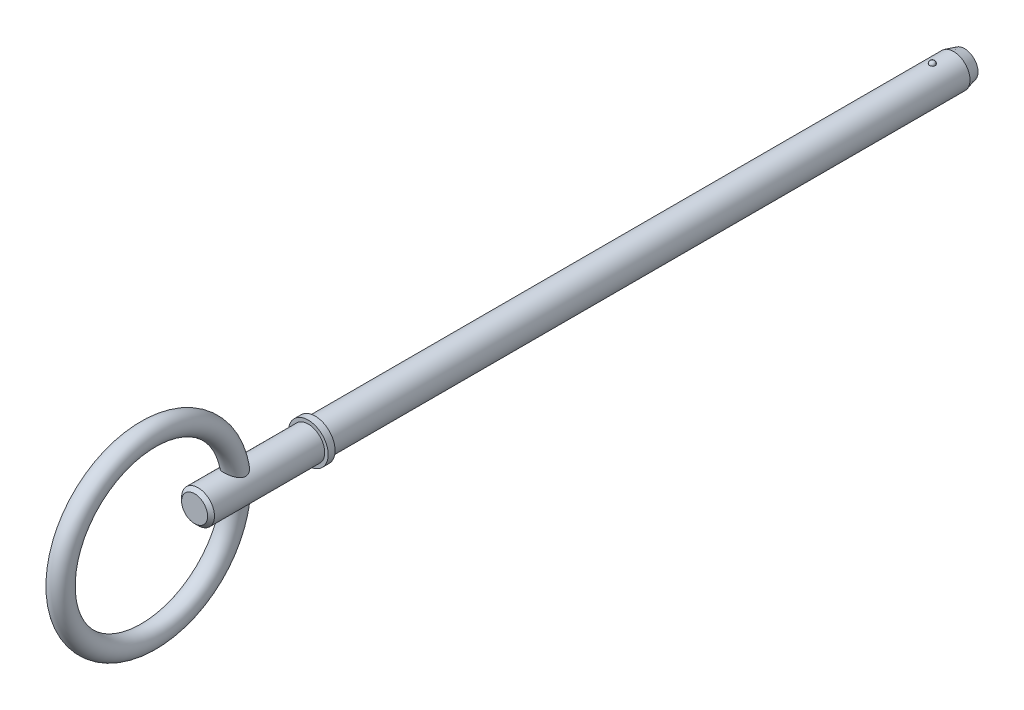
ISO-10303-21;
HEADER;
FILE_DESCRIPTION(('STEP AP214'),'2;1');
FILE_NAME('part.step','',(''),(''),'','','');
FILE_SCHEMA(('AUTOMOTIVE_DESIGN { 1 0 10303 214 1 1 1 1 }'));
ENDSEC;
DATA;
#1=APPLICATION_CONTEXT('core data for automotive mechanical design processes');
#2=APPLICATION_PROTOCOL_DEFINITION('international standard','automotive_design',2000,#1);
#3=PRODUCT_CONTEXT('',#1,'mechanical');
#4=PRODUCT('Part','Part','',(#3));
#5=PRODUCT_RELATED_PRODUCT_CATEGORY('part','',(#4));
#6=PRODUCT_DEFINITION_FORMATION('','',#4);
#7=PRODUCT_DEFINITION_CONTEXT('part definition',#1,'design');
#8=PRODUCT_DEFINITION('design','',#6,#7);
#9=PRODUCT_DEFINITION_SHAPE('','',#8);
#10=(LENGTH_UNIT() NAMED_UNIT(*) SI_UNIT(.MILLI.,.METRE.));
#11=(NAMED_UNIT(*) PLANE_ANGLE_UNIT() SI_UNIT($,.RADIAN.));
#12=(NAMED_UNIT(*) SI_UNIT($,.STERADIAN.) SOLID_ANGLE_UNIT());
#13=UNCERTAINTY_MEASURE_WITH_UNIT(LENGTH_MEASURE(1.E-05),#10,'distance_accuracy_value','');
#14=(GEOMETRIC_REPRESENTATION_CONTEXT(3) GLOBAL_UNCERTAINTY_ASSIGNED_CONTEXT((#13)) GLOBAL_UNIT_ASSIGNED_CONTEXT((#10,
#11,#12)) REPRESENTATION_CONTEXT('',''));
#15=CARTESIAN_POINT('',(0.,0.,0.));
#16=DIRECTION('',(0.,0.,1.));
#17=DIRECTION('',(1.,0.,0.));
#18=AXIS2_PLACEMENT_3D('',#15,#16,#17);
#19=CARTESIAN_POINT('',(0.,0.,88.9));
#20=DIRECTION('',(0.,0.,-1.));
#21=DIRECTION('',(-1.,0.,0.));
#22=AXIS2_PLACEMENT_3D('',#19,#20,#21);
#23=CYLINDRICAL_SURFACE('',#22,2.38);
#24=CARTESIAN_POINT('',(0.418361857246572,2.34294117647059,-0.419999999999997));
#25=CARTESIAN_POINT('',(0.418361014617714,2.34294160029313,-0.396453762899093));
#26=CARTESIAN_POINT('',(0.416399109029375,2.34329426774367,-0.372895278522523));
#27=CARTESIAN_POINT('',(0.408599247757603,2.34466666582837,-0.32643458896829));
#28=CARTESIAN_POINT('',(0.402757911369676,2.34568697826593,-0.303532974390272));
#29=CARTESIAN_POINT('',(0.387358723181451,2.3482789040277,-0.259059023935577));
#30=CARTESIAN_POINT('',(0.377802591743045,2.34985026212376,-0.237486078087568));
#31=CARTESIAN_POINT('',(0.355233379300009,2.35336760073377,-0.196270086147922));
#32=CARTESIAN_POINT('',(0.34222083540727,2.3553135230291,-0.176626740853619));
#33=CARTESIAN_POINT('',(0.313060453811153,2.35936636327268,-0.139777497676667));
#34=CARTESIAN_POINT('',(0.296906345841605,2.36147359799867,-0.122576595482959));
#35=CARTESIAN_POINT('',(0.261921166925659,2.3656092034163,-0.0911421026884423));
#36=CARTESIAN_POINT('',(0.243090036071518,2.36763757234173,-0.0769085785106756));
#37=CARTESIAN_POINT('',(0.203297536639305,2.37138533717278,-0.0518262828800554));
#38=CARTESIAN_POINT('',(0.182338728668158,2.37310509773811,-0.0409735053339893));
#39=CARTESIAN_POINT('',(0.138864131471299,2.37604521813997,-0.0229395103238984));
#40=CARTESIAN_POINT('',(0.116348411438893,2.37726560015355,-0.0157581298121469));
#41=CARTESIAN_POINT('',(0.0705754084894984,2.37906276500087,-0.00531205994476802));
#42=CARTESIAN_POINT('',(0.0473247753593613,2.37964420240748,-0.00201903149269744));
#43=CARTESIAN_POINT('',(0.000593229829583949,2.38011460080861,0.000651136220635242));
#44=CARTESIAN_POINT('',(-0.0228876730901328,2.38000359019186,2.84360175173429E-05));
#45=CARTESIAN_POINT('',(-0.0692686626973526,2.37910422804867,-0.00509943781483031));
#46=CARTESIAN_POINT('',(-0.0921713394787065,2.37831983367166,-0.00958192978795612));
#47=CARTESIAN_POINT('',(-0.136890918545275,2.37616546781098,-0.022272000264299));
#48=CARTESIAN_POINT('',(-0.158707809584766,2.37479549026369,-0.0304796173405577));
#49=CARTESIAN_POINT('',(-0.200704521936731,2.37161607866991,-0.0504168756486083));
#50=CARTESIAN_POINT('',(-0.220879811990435,2.36980547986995,-0.0621558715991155));
#51=CARTESIAN_POINT('',(-0.258974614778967,2.36594575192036,-0.0888218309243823));
#52=CARTESIAN_POINT('',(-0.276894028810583,2.36389661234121,-0.103748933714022));
#53=CARTESIAN_POINT('',(-0.310124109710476,2.35976825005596,-0.136509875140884));
#54=CARTESIAN_POINT('',(-0.325413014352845,2.35768891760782,-0.154365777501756));
#55=CARTESIAN_POINT('',(-0.352793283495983,2.35374782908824,-0.192402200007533));
#56=CARTESIAN_POINT('',(-0.364884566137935,2.35188607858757,-0.212582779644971));
#57=CARTESIAN_POINT('',(-0.385587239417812,2.34858114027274,-0.254794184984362));
#58=CARTESIAN_POINT('',(-0.394183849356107,2.34713973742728,-0.276832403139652));
#59=CARTESIAN_POINT('',(-0.407590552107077,2.3448489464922,-0.322061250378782));
#60=CARTESIAN_POINT('',(-0.412400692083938,2.34399955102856,-0.34525186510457));
#61=CARTESIAN_POINT('',(-0.418098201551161,2.34299005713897,-0.392078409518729));
#62=CARTESIAN_POINT('',(-0.41899328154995,2.34282860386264,-0.415713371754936));
#63=CARTESIAN_POINT('',(-0.416857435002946,2.34320955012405,-0.462799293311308));
#64=CARTESIAN_POINT('',(-0.413826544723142,2.34375194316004,-0.486250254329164));
#65=CARTESIAN_POINT('',(-0.403929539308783,2.34547773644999,-0.532261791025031));
#66=CARTESIAN_POINT('',(-0.397069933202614,2.34666004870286,-0.554823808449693));
#67=CARTESIAN_POINT('',(-0.379705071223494,2.34953208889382,-0.59846383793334));
#68=CARTESIAN_POINT('',(-0.369199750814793,2.35122182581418,-0.61954182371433));
#69=CARTESIAN_POINT('',(-0.344797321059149,2.35492396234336,-0.659671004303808));
#70=CARTESIAN_POINT('',(-0.33089223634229,2.35693711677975,-0.678717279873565));
#71=CARTESIAN_POINT('',(-0.300080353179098,2.36105754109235,-0.714192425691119));
#72=CARTESIAN_POINT('',(-0.283173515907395,2.36316481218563,-0.730621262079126));
#73=CARTESIAN_POINT('',(-0.246801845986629,2.36723962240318,-0.760416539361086));
#74=CARTESIAN_POINT('',(-0.227334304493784,2.36920701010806,-0.773779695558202));
#75=CARTESIAN_POINT('',(-0.186398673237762,2.37277833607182,-0.797042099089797));
#76=CARTESIAN_POINT('',(-0.164930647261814,2.37438228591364,-0.806941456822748));
#77=CARTESIAN_POINT('',(-0.120727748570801,2.37703848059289,-0.82294821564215));
#78=CARTESIAN_POINT('',(-0.0980005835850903,2.37809374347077,-0.829076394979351));
#79=CARTESIAN_POINT('',(-0.0518218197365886,2.37954782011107,-0.837451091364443));
#80=CARTESIAN_POINT('',(-0.0283702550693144,2.37994666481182,-0.839697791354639));
#81=CARTESIAN_POINT('',(0.0184023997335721,2.38004290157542,-0.840243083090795));
#82=CARTESIAN_POINT('',(0.0417231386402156,2.37974556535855,-0.838571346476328));
#83=CARTESIAN_POINT('',(0.0877471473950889,2.37849333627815,-0.831389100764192));
#84=CARTESIAN_POINT('',(0.110450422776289,2.37753844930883,-0.825878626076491));
#85=CARTESIAN_POINT('',(0.154584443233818,2.37507730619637,-0.811179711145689));
#86=CARTESIAN_POINT('',(0.17601599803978,2.37357140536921,-0.801993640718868));
#87=CARTESIAN_POINT('',(0.217028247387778,2.37017355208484,-0.780200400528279));
#88=CARTESIAN_POINT('',(0.236608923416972,2.36828159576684,-0.767593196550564));
#89=CARTESIAN_POINT('',(0.27351405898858,2.36430486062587,-0.739207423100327));
#90=CARTESIAN_POINT('',(0.290821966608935,2.36221883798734,-0.723407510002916));
#91=CARTESIAN_POINT('',(0.322554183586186,2.3580957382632,-0.68912612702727));
#92=CARTESIAN_POINT('',(0.336977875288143,2.35605867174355,-0.670644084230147));
#93=CARTESIAN_POINT('',(0.362636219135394,2.35224677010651,-0.63138169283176));
#94=CARTESIAN_POINT('',(0.373848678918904,2.35047379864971,-0.610586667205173));
#95=CARTESIAN_POINT('',(0.392641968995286,2.34740786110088,-0.567397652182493));
#96=CARTESIAN_POINT('',(0.400225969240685,2.34611447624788,-0.545005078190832));
#97=CARTESIAN_POINT('',(0.410033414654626,2.34441668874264,-0.505456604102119));
#98=CARTESIAN_POINT('',(0.413152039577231,2.34386644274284,-0.488523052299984));
#99=CARTESIAN_POINT('',(0.417316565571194,2.34312853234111,-0.454395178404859));
#100=CARTESIAN_POINT('',(0.418362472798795,2.34294086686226,-0.437200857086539));
#101=CARTESIAN_POINT('',(0.418361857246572,2.34294117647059,-0.419999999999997));
#102=B_SPLINE_CURVE_WITH_KNOTS('',3,(#24,#25,#26,#27,#28,#29,#30,#31,#32,#33,#34,#35,#36,#37,
#38,#39,#40,#41,#42,#43,#44,#45,#46,#47,#48,#49,#50,#51,#52,#53,#54,#55,#56,#57,#58,#59,#60,#61,
#62,#63,#64,#65,#66,#67,#68,#69,#70,#71,#72,#73,#74,#75,#76,#77,#78,#79,#80,#81,#82,#83,#84,#85,
#86,#87,#88,#89,#90,#91,#92,#93,#94,#95,#96,#97,#98,#99,#100,#101),.UNSPECIFIED.,.T.,.F.,(4,2,2,
2,2,2,2,2,2,2,2,2,2,2,2,2,2,2,2,2,2,2,2,2,2,2,2,2,2,2,2,2,2,2,2,2,2,2,4),(0.,0.0705763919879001,
0.141214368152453,0.211819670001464,0.282414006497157,0.353150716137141,0.423889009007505,
0.494543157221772,0.565194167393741,0.635327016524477,0.705456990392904,0.77517764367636,
0.844899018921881,0.914806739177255,0.98471751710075,1.05518143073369,1.1256471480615,
1.19640787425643,1.26716771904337,1.33778814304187,1.40840791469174,1.47890799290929,
1.54940931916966,1.62007764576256,1.69074688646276,1.76149149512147,1.83223384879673,
1.90258285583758,1.97292854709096,2.04274328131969,2.11255738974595,2.18232655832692,
2.25209642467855,2.32234913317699,2.39261687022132,2.4633591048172,2.5340394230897,
2.58559662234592,2.63715366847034),.UNSPECIFIED.);
#103=CARTESIAN_POINT('',(0.418361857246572,2.34294117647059,-0.419999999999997));
#104=VERTEX_POINT('',#103);
#105=EDGE_CURVE('E101',#104,#104,#102,.T.);
#106=ORIENTED_EDGE('',*,*,#105,.T.);
#107=EDGE_LOOP('',(#106));
#108=FACE_BOUND('',#107,.T.);
#109=CARTESIAN_POINT('',(0.,0.,-3.49399999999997));
#110=DIRECTION('',(0.,0.,-1.));
#111=DIRECTION('',(-1.,0.,0.));
#112=AXIS2_PLACEMENT_3D('',#109,#110,#111);
#113=CIRCLE('',#112,2.38);
#114=CARTESIAN_POINT('',(-2.38,0.,-3.49399999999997));
#115=VERTEX_POINT('',#114);
#116=EDGE_CURVE('E109',#115,#115,#113,.F.);
#117=ORIENTED_EDGE('',*,*,#116,.T.);
#118=EDGE_LOOP('',(#117));
#119=FACE_BOUND('',#118,.T.);
#120=CARTESIAN_POINT('',(0.,0.,88.9));
#121=DIRECTION('',(0.,0.,1.));
#122=DIRECTION('',(1.,0.,0.));
#123=AXIS2_PLACEMENT_3D('',#120,#121,#122);
#124=CIRCLE('',#123,2.38);
#125=CARTESIAN_POINT('',(2.38,0.,88.9));
#126=VERTEX_POINT('',#125);
#127=EDGE_CURVE('E107',#126,#126,#124,.T.);
#128=ORIENTED_EDGE('',*,*,#127,.F.);
#129=EDGE_LOOP('',(#128));
#130=FACE_BOUND('',#129,.T.);
#131=ADVANCED_FACE('F39',(#108,#119,#130),#23,.T.);
#132=CARTESIAN_POINT('',(0.,0.,-5.08));
#133=DIRECTION('',(0.,0.,-1.));
#134=DIRECTION('',(-1.,0.,0.));
#135=AXIS2_PLACEMENT_3D('',#132,#133,#134);
#136=PLANE('',#135);
#137=CARTESIAN_POINT('',(0.,0.,-5.08));
#138=DIRECTION('',(0.,0.,-1.));
#139=DIRECTION('',(-1.,0.,0.));
#140=AXIS2_PLACEMENT_3D('',#137,#138,#139);
#141=CIRCLE('',#140,1.95503258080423);
#142=CARTESIAN_POINT('',(-1.95503258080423,0.,-5.08));
#143=VERTEX_POINT('',#142);
#144=EDGE_CURVE('E141',#143,#143,#141,.T.);
#145=ORIENTED_EDGE('',*,*,#144,.T.);
#146=EDGE_LOOP('',(#145));
#147=FACE_BOUND('',#146,.T.);
#148=ADVANCED_FACE('F87',(#147),#136,.T.);
#149=CARTESIAN_POINT('',(0.,0.,-5.08));
#150=DIRECTION('',(0.,0.,1.));
#151=DIRECTION('',(1.,0.,0.));
#152=AXIS2_PLACEMENT_3D('',#149,#150,#151);
#153=CONICAL_SURFACE('',#152,1.95503258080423,0.261799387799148);
#154=ORIENTED_EDGE('',*,*,#116,.F.);
#155=EDGE_LOOP('',(#154));
#156=FACE_BOUND('',#155,.T.);
#157=ORIENTED_EDGE('',*,*,#144,.F.);
#158=EDGE_LOOP('',(#157));
#159=FACE_BOUND('',#158,.T.);
#160=ADVANCED_FACE('F93',(#156,#159),#153,.T.);
#161=CARTESIAN_POINT('',(0.,2.38,-0.419999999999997));
#162=DIRECTION('',(0.,1.,0.));
#163=DIRECTION('',(0.,0.,1.));
#164=AXIS2_PLACEMENT_3D('',#161,#162,#163);
#165=SPHERICAL_SURFACE('',#164,0.419999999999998);
#166=ORIENTED_EDGE('',*,*,#105,.F.);
#167=EDGE_LOOP('',(#166));
#168=FACE_BOUND('',#167,.T.);
#169=ADVANCED_FACE('F112',(#168),#165,.T.);
#170=CARTESIAN_POINT('',(0.,0.,88.9));
#171=DIRECTION('',(0.,0.,-1.));
#172=DIRECTION('',(-1.,0.,0.));
#173=AXIS2_PLACEMENT_3D('',#170,#171,#172);
#174=PLANE('',#173);
#175=ORIENTED_EDGE('',*,*,#127,.T.);
#176=EDGE_LOOP('',(#175));
#177=FACE_BOUND('',#176,.T.);
#178=CARTESIAN_POINT('',(0.,0.,88.9));
#179=DIRECTION('',(0.,0.,-1.));
#180=DIRECTION('',(-1.,0.,0.));
#181=AXIS2_PLACEMENT_3D('',#178,#179,#180);
#182=CIRCLE('',#181,2.88);
#183=CARTESIAN_POINT('',(-2.88,0.,88.9));
#184=VERTEX_POINT('',#183);
#185=EDGE_CURVE('E108',#184,#184,#182,.T.);
#186=ORIENTED_EDGE('',*,*,#185,.T.);
#187=EDGE_LOOP('',(#186));
#188=FACE_BOUND('',#187,.T.);
#189=ADVANCED_FACE('F116',(#177,#188),#174,.T.);
#190=CARTESIAN_POINT('',(0.,0.,33.7287874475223));
#191=DIRECTION('',(0.,0.,-1.));
#192=DIRECTION('',(-1.,0.,0.));
#193=AXIS2_PLACEMENT_3D('',#190,#191,#192);
#194=CYLINDRICAL_SURFACE('',#193,2.88);
#195=CARTESIAN_POINT('',(0.,0.,89.9));
#196=DIRECTION('',(0.,0.,-1.));
#197=DIRECTION('',(-1.,0.,0.));
#198=AXIS2_PLACEMENT_3D('',#195,#196,#197);
#199=CIRCLE('',#198,2.88);
#200=CARTESIAN_POINT('',(-2.88,0.,89.9));
#201=VERTEX_POINT('',#200);
#202=EDGE_CURVE('E133',#201,#201,#199,.T.);
#203=ORIENTED_EDGE('',*,*,#202,.T.);
#204=EDGE_LOOP('',(#203));
#205=FACE_BOUND('',#204,.T.);
#206=ORIENTED_EDGE('',*,*,#185,.F.);
#207=EDGE_LOOP('',(#206));
#208=FACE_BOUND('',#207,.T.);
#209=ADVANCED_FACE('F120',(#205,#208),#194,.T.);
#210=CARTESIAN_POINT('',(0.,2.88,89.9));
#211=DIRECTION('',(0.,0.,1.));
#212=DIRECTION('',(1.,0.,0.));
#213=AXIS2_PLACEMENT_3D('',#210,#211,#212);
#214=PLANE('',#213);
#215=CARTESIAN_POINT('',(0.,0.,89.9));
#216=DIRECTION('',(0.,0.,1.));
#217=DIRECTION('',(1.,0.,0.));
#218=AXIS2_PLACEMENT_3D('',#215,#216,#217);
#219=CIRCLE('',#218,2.38);
#220=CARTESIAN_POINT('',(2.38,0.,89.9));
#221=VERTEX_POINT('',#220);
#222=EDGE_CURVE('E111',#221,#221,#219,.T.);
#223=ORIENTED_EDGE('',*,*,#222,.F.);
#224=EDGE_LOOP('',(#223));
#225=FACE_BOUND('',#224,.T.);
#226=ORIENTED_EDGE('',*,*,#202,.F.);
#227=EDGE_LOOP('',(#226));
#228=FACE_BOUND('',#227,.T.);
#229=ADVANCED_FACE('F84',(#225,#228),#214,.T.);
#230=CARTESIAN_POINT('',(0.,0.,106.35));
#231=DIRECTION('',(0.,0.,-1.));
#232=DIRECTION('',(-1.,0.,0.));
#233=AXIS2_PLACEMENT_3D('',#230,#231,#232);
#234=CYLINDRICAL_SURFACE('',#233,2.38);
#235=CARTESIAN_POINT('',(-0.903407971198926,-2.20187511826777,99.328101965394));
#236=CARTESIAN_POINT('',(-0.839710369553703,-2.22800560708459,99.2836275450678));
#237=CARTESIAN_POINT('',(-0.771955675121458,-2.25255828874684,99.2439200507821));
#238=CARTESIAN_POINT('',(-0.629623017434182,-2.29641711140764,99.1749006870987));
#239=CARTESIAN_POINT('',(-0.555034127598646,-2.31571464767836,99.1456058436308));
#240=CARTESIAN_POINT('',(-0.400673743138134,-2.34735542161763,99.0982943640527));
#241=CARTESIAN_POINT('',(-0.320887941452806,-2.35967847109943,99.0803104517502));
#242=CARTESIAN_POINT('',(-0.158738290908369,-2.37609587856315,99.0564617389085));
#243=CARTESIAN_POINT('',(-0.0763765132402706,-2.38019668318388,99.0505874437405));
#244=CARTESIAN_POINT('',(0.0836658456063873,-2.3797998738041,99.0511603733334));
#245=CARTESIAN_POINT('',(0.161351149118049,-2.37576936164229,99.0569382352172));
#246=CARTESIAN_POINT('',(0.314409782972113,-2.36039486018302,99.0792676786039));
#247=CARTESIAN_POINT('',(0.3897828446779,-2.34905002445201,99.0958205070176));
#248=CARTESIAN_POINT('',(0.535937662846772,-2.32006569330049,99.1390515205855));
#249=CARTESIAN_POINT('',(0.606735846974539,-2.30245039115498,99.1656908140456));
#250=CARTESIAN_POINT('',(0.742521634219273,-2.26231731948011,99.2283720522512));
#251=CARTESIAN_POINT('',(0.807508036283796,-2.23979853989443,99.2644159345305));
#252=CARTESIAN_POINT('',(0.935326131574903,-2.18966592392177,99.3483563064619));
#253=CARTESIAN_POINT('',(0.997591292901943,-2.16179128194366,99.3969595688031));
#254=CARTESIAN_POINT('',(1.11292144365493,-2.10474548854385,99.5035603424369));
#255=CARTESIAN_POINT('',(1.16597568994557,-2.07557287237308,99.5615686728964));
#256=CARTESIAN_POINT('',(1.26477130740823,-2.01699124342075,99.6902977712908));
#257=CARTESIAN_POINT('',(1.30983402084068,-1.98768494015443,99.7615920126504));
#258=CARTESIAN_POINT('',(1.38660631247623,-1.93491744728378,99.9129637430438));
#259=CARTESIAN_POINT('',(1.41834090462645,-1.91144534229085,99.9930244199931));
#260=CARTESIAN_POINT('',(1.46422131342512,-1.87648847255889,100.150694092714));
#261=CARTESIAN_POINT('',(1.47990731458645,-1.86397592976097,100.227619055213));
#262=CARTESIAN_POINT('',(1.49871691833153,-1.84889326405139,100.383897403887));
#263=CARTESIAN_POINT('',(1.50185388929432,-1.84631256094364,100.463248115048));
#264=CARTESIAN_POINT('',(1.4964844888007,-1.85065563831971,100.608847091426));
#265=CARTESIAN_POINT('',(1.48970686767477,-1.85616871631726,100.67522048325));
#266=CARTESIAN_POINT('',(1.46828795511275,-1.87315650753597,100.805907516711));
#267=CARTESIAN_POINT('',(1.4536391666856,-1.88463690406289,100.870219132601));
#268=CARTESIAN_POINT('',(1.40943250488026,-1.91806137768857,101.023064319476));
#269=CARTESIAN_POINT('',(1.37616344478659,-1.94238425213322,101.109999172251));
#270=CARTESIAN_POINT('',(1.29708737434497,-1.99605834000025,101.276348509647));
#271=CARTESIAN_POINT('',(1.25125268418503,-2.02542060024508,101.355745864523));
#272=CARTESIAN_POINT('',(1.14695036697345,-2.08629729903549,101.507628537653));
#273=CARTESIAN_POINT('',(1.08823347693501,-2.11784433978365,101.579929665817));
#274=CARTESIAN_POINT('',(0.959228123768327,-2.17930599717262,101.714070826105));
#275=CARTESIAN_POINT('',(0.888958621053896,-2.20922318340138,101.775927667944));
#276=CARTESIAN_POINT('',(0.753368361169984,-2.25851185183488,101.874933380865));
#277=CARTESIAN_POINT('',(0.690173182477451,-2.2787729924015,101.91453921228));
#278=CARTESIAN_POINT('',(0.557409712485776,-2.31482439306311,101.983984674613));
#279=CARTESIAN_POINT('',(0.487846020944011,-2.3306178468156,102.013831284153));
#280=CARTESIAN_POINT('',(0.342953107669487,-2.35631858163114,102.062025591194));
#281=CARTESIAN_POINT('',(0.26757466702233,-2.36616750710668,102.080259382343));
#282=CARTESIAN_POINT('',(0.114199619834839,-2.37849775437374,102.103046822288));
#283=CARTESIAN_POINT('',(0.0362059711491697,-2.3809871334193,102.107615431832));
#284=CARTESIAN_POINT('',(-0.107568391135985,-2.37849121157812,102.10301636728));
#285=CARTESIAN_POINT('',(-0.173440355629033,-2.37456249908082,102.095790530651));
#286=CARTESIAN_POINT('',(-0.302853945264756,-2.36154811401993,102.071690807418));
#287=CARTESIAN_POINT('',(-0.366395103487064,-2.35246141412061,102.054814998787));
#288=CARTESIAN_POINT('',(-0.489880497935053,-2.32988758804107,102.012434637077));
#289=CARTESIAN_POINT('',(-0.549812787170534,-2.31638670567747,101.98690310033));
#290=CARTESIAN_POINT('',(-0.665021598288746,-2.28597979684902,101.928489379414));
#291=CARTESIAN_POINT('',(-0.720295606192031,-2.26907194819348,101.895603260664));
#292=CARTESIAN_POINT('',(-0.851132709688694,-2.22413718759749,101.806311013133));
#293=CARTESIAN_POINT('',(-0.923680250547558,-2.19467168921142,101.746196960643));
#294=CARTESIAN_POINT('',(-1.05722916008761,-2.13356097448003,101.615066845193));
#295=CARTESIAN_POINT('',(-1.11820078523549,-2.1019104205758,101.544023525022));
#296=CARTESIAN_POINT('',(-1.22894457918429,-2.0391654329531,101.391611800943));
#297=CARTESIAN_POINT('',(-1.27853191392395,-2.00808682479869,101.310102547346));
#298=CARTESIAN_POINT('',(-1.36422650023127,-1.95088121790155,101.138753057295));
#299=CARTESIAN_POINT('',(-1.40036235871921,-1.9247437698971,101.048931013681));
#300=CARTESIAN_POINT('',(-1.44943039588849,-1.88791548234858,100.887739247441));
#301=CARTESIAN_POINT('',(-1.46600167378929,-1.87495651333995,100.818005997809));
#302=CARTESIAN_POINT('',(-1.48984634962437,-1.8560704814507,100.676055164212));
#303=CARTESIAN_POINT('',(-1.49713400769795,-1.85013263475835,100.603841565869));
#304=CARTESIAN_POINT('',(-1.5014924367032,-1.84660099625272,100.458363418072));
#305=CARTESIAN_POINT('',(-1.4984943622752,-1.84906342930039,100.385095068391));
#306=CARTESIAN_POINT('',(-1.48179888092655,-1.8624661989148,100.24056804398));
#307=CARTESIAN_POINT('',(-1.46809860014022,-1.87340881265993,100.169309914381));
#308=CARTESIAN_POINT('',(-1.43218989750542,-1.90096973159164,100.037281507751));
#309=CARTESIAN_POINT('',(-1.41085045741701,-1.91699396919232,99.9761429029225));
#310=CARTESIAN_POINT('',(-1.36038958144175,-1.95312601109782,99.8584385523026));
#311=CARTESIAN_POINT('',(-1.33126141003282,-1.97323734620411,99.8018768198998));
#312=CARTESIAN_POINT('',(-1.26173108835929,-2.0185059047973,99.6870500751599));
#313=CARTESIAN_POINT('',(-1.22036168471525,-2.04397945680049,99.6294985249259));
#314=CARTESIAN_POINT('',(-1.12954254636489,-2.09553139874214,99.5216488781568));
#315=CARTESIAN_POINT('',(-1.08010424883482,-2.12160888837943,99.4713407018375));
#316=CARTESIAN_POINT('',(-0.987769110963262,-2.16578285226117,99.3904848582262));
#317=CARTESIAN_POINT('',(-0.946517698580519,-2.18419033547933,99.3582016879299));
#318=CARTESIAN_POINT('',(-0.903407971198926,-2.20187511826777,99.328101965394));
#319=B_SPLINE_CURVE_WITH_KNOTS('',3,(#235,#236,#237,#238,#239,#240,#241,#242,#243,#244,#245,
#246,#247,#248,#249,#250,#251,#252,#253,#254,#255,#256,#257,#258,#259,#260,#261,#262,#263,#264,
#265,#266,#267,#268,#269,#270,#271,#272,#273,#274,#275,#276,#277,#278,#279,#280,#281,#282,#283,
#284,#285,#286,#287,#288,#289,#290,#291,#292,#293,#294,#295,#296,#297,#298,#299,#300,#301,#302,
#303,#304,#305,#306,#307,#308,#309,#310,#311,#312,#313,#314,#315,#316,#317,#318),.UNSPECIFIED.,
.T.,.F.,(4,2,2,2,2,2,2,2,2,2,2,2,2,2,2,2,2,2,2,2,2,2,2,2,2,2,2,2,2,2,2,2,2,2,2,2,2,2,2,2,2,4),
(0.,0.24572726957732,0.49185450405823,0.738690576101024,0.985333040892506,1.21821047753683,
1.45111486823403,1.68313021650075,1.9151934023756,2.16541572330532,2.41592795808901,
2.68235417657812,2.94827811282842,3.18521517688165,3.42189976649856,3.62191159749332,
3.82211427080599,4.10918949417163,4.39690224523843,4.69076958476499,4.98415935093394,
5.2151557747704,5.4459866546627,5.67904815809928,5.91185441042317,6.11003726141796,
6.3082595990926,6.50710565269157,6.70605834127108,7.00062466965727,7.29593791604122,
7.5957515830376,7.89492395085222,8.11262207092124,8.32998539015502,8.54880641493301,
8.76768621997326,8.96702101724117,9.16652875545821,9.39164791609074,9.61645071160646,
9.78275580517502),.UNSPECIFIED.);
#320=CARTESIAN_POINT('',(-0.903407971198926,-2.20187511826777,99.328101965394));
#321=VERTEX_POINT('',#320);
#322=EDGE_CURVE('E10',#321,#321,#319,.T.);
#323=ORIENTED_EDGE('',*,*,#322,.F.);
#324=EDGE_LOOP('',(#323));
#325=FACE_BOUND('',#324,.T.);
#326=CARTESIAN_POINT('',(-0.903407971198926,2.20187511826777,99.328101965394));
#327=CARTESIAN_POINT('',(-0.970214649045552,2.17445928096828,99.3747550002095));
#328=CARTESIAN_POINT('',(-1.03268838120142,2.14525344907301,99.4267440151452));
#329=CARTESIAN_POINT('',(-1.1477077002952,2.0859961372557,99.5406478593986));
#330=CARTESIAN_POINT('',(-1.20022114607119,2.05594226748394,99.6025936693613));
#331=CARTESIAN_POINT('',(-1.2941155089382,1.99817720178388,99.7359266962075));
#332=CARTESIAN_POINT('',(-1.33544720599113,1.9704767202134,99.8073536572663));
#333=CARTESIAN_POINT('',(-1.40506760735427,1.92146090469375,99.9582024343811));
#334=CARTESIAN_POINT('',(-1.43339046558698,1.90012890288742,100.037602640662));
#335=CARTESIAN_POINT('',(-1.47338334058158,1.86925714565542,100.193449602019));
#336=CARTESIAN_POINT('',(-1.48649837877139,1.85870842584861,100.269319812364));
#337=CARTESIAN_POINT('',(-1.50071746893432,1.8472518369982,100.42287045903));
#338=CARTESIAN_POINT('',(-1.50182784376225,1.84633889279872,100.500549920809));
#339=CARTESIAN_POINT('',(-1.49326645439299,1.85325786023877,100.643985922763));
#340=CARTESIAN_POINT('',(-1.48506604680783,1.85989666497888,100.709904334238));
#341=CARTESIAN_POINT('',(-1.46099386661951,1.87886395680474,100.839479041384));
#342=CARTESIAN_POINT('',(-1.44511553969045,1.8911973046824,100.903133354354));
#343=CARTESIAN_POINT('',(-1.39754250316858,1.92678855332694,101.056153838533));
#344=CARTESIAN_POINT('',(-1.36192725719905,1.95245999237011,101.14373726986));
#345=CARTESIAN_POINT('',(-1.27788657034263,2.00847209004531,101.310990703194));
#346=CARTESIAN_POINT('',(-1.22943137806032,2.03882352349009,101.39064172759));
#347=CARTESIAN_POINT('',(-1.11958027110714,2.10119412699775,101.542420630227));
#348=CARTESIAN_POINT('',(-1.05794784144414,2.13323438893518,101.614369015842));
#349=CARTESIAN_POINT('',(-0.922772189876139,2.19508493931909,101.747080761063));
#350=CARTESIAN_POINT('',(-0.849252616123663,2.22489948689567,101.807865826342));
#351=CARTESIAN_POINT('',(-0.710152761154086,2.27246326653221,101.902311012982));
#352=CARTESIAN_POINT('',(-0.647015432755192,2.29138112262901,101.938970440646));
#353=CARTESIAN_POINT('',(-0.514878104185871,2.32463484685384,102.002588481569));
#354=CARTESIAN_POINT('',(-0.445882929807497,2.3389744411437,102.02955498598));
#355=CARTESIAN_POINT('',(-0.30279701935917,2.36177853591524,102.072162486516));
#356=CARTESIAN_POINT('',(-0.228666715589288,2.37019011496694,102.087701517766));
#357=CARTESIAN_POINT('',(-0.0783799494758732,2.37989644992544,102.105616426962));
#358=CARTESIAN_POINT('',(-0.00222521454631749,2.38119708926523,102.108003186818));
#359=CARTESIAN_POINT('',(0.138818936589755,2.37685303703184,102.099998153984));
#360=CARTESIAN_POINT('',(0.203841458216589,2.37212211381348,102.091287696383));
#361=CARTESIAN_POINT('',(0.331347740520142,2.3576952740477,102.06453097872));
#362=CARTESIAN_POINT('',(0.393830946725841,2.34799827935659,102.046482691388));
#363=CARTESIAN_POINT('',(0.516206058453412,2.32419976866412,102.001683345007));
#364=CARTESIAN_POINT('',(0.576015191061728,2.31000942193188,101.97475627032));
#365=CARTESIAN_POINT('',(0.690806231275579,2.27831963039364,101.913611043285));
#366=CARTESIAN_POINT('',(0.745785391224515,2.26081831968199,101.879388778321));
#367=CARTESIAN_POINT('',(0.87607156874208,2.21443701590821,101.786610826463));
#368=CARTESIAN_POINT('',(0.948236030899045,2.18416686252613,101.724322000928));
#369=CARTESIAN_POINT('',(1.08068664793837,2.121767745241,101.588804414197));
#370=CARTESIAN_POINT('',(1.14094076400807,2.08963406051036,101.515547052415));
#371=CARTESIAN_POINT('',(1.24978363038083,2.02643655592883,101.358659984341));
#372=CARTESIAN_POINT('',(1.29819307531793,1.99539463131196,101.27489682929));
#373=CARTESIAN_POINT('',(1.38094965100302,1.93904233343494,101.09899624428));
#374=CARTESIAN_POINT('',(1.41533296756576,1.91371728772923,101.006881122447));
#375=CARTESIAN_POINT('',(1.46011713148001,1.879629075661,100.843926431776));
#376=CARTESIAN_POINT('',(1.47459501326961,1.86818653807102,100.774777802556));
#377=CARTESIAN_POINT('',(1.49436605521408,1.8524142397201,100.634403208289));
#378=CARTESIAN_POINT('',(1.49967306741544,1.84807375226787,100.563180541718));
#379=CARTESIAN_POINT('',(1.50029887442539,1.84756805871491,100.420229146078));
#380=CARTESIAN_POINT('',(1.49556248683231,1.85144801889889,100.348499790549));
#381=CARTESIAN_POINT('',(1.4758165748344,1.8672219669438,100.207351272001));
#382=CARTESIAN_POINT('',(1.46080121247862,1.87912050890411,100.137933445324));
#383=CARTESIAN_POINT('',(1.42246467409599,1.90827733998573,100.008219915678));
#384=CARTESIAN_POINT('',(1.39980172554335,1.9250999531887,99.9476260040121));
#385=CARTESIAN_POINT('',(1.34679091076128,1.96255086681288,99.8311857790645));
#386=CARTESIAN_POINT('',(1.31644034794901,1.98318050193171,99.7753411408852));
#387=CARTESIAN_POINT('',(1.24396057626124,2.02954647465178,99.6614514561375));
#388=CARTESIAN_POINT('',(1.20077385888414,2.05559269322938,99.6042068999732));
#389=CARTESIAN_POINT('',(1.10616417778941,2.10801594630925,99.4971320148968));
#390=CARTESIAN_POINT('',(1.05473535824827,2.13439320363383,99.4473070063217));
#391=CARTESIAN_POINT('',(0.936202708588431,2.18924478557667,99.3487347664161));
#392=CARTESIAN_POINT('',(0.867904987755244,2.21744450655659,99.3012583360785));
#393=CARTESIAN_POINT('',(0.722917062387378,2.26885521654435,99.2177494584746));
#394=CARTESIAN_POINT('',(0.646227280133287,2.29206645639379,99.1817164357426));
#395=CARTESIAN_POINT('',(0.487515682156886,2.33094430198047,99.122591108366));
#396=CARTESIAN_POINT('',(0.405587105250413,2.34671524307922,99.0993190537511));
#397=CARTESIAN_POINT('',(0.237955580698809,2.36958127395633,99.0658521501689));
#398=CARTESIAN_POINT('',(0.152255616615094,2.37668309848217,99.0556471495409));
#399=CARTESIAN_POINT('',(-0.0122990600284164,2.38126478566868,99.0490505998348));
#400=CARTESIAN_POINT('',(-0.091088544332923,2.37954037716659,99.0515167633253));
#401=CARTESIAN_POINT('',(-0.247004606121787,2.36843740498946,99.0675699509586));
#402=CARTESIAN_POINT('',(-0.324130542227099,2.35905594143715,99.0811611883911));
#403=CARTESIAN_POINT('',(-0.473048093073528,2.33371594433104,99.1185984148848));
#404=CARTESIAN_POINT('',(-0.544914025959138,2.31788812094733,99.1422409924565));
#405=CARTESIAN_POINT('',(-0.683201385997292,2.28095222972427,99.1990265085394));
#406=CARTESIAN_POINT('',(-0.749631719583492,2.25985303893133,99.2321534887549));
#407=CARTESIAN_POINT('',(-0.843767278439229,2.22565914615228,99.2880726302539));
#408=CARTESIAN_POINT('',(-0.874007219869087,2.21394047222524,99.3075705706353));
#409=CARTESIAN_POINT('',(-0.903407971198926,2.20187511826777,99.328101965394));
#410=B_SPLINE_CURVE_WITH_KNOTS('',3,(#326,#327,#328,#329,#330,#331,#332,#333,#334,#335,#336,
#337,#338,#339,#340,#341,#342,#343,#344,#345,#346,#347,#348,#349,#350,#351,#352,#353,#354,#355,
#356,#357,#358,#359,#360,#361,#362,#363,#364,#365,#366,#367,#368,#369,#370,#371,#372,#373,#374,
#375,#376,#377,#378,#379,#380,#381,#382,#383,#384,#385,#386,#387,#388,#389,#390,#391,#392,#393,
#394,#395,#396,#397,#398,#399,#400,#401,#402,#403,#404,#405,#406,#407,#408,#409),.UNSPECIFIED.,
.T.,.F.,(4,2,2,2,2,2,2,2,2,2,2,2,2,2,2,2,2,2,2,2,2,2,2,2,2,2,2,2,2,2,2,2,2,2,2,2,2,2,2,2,2,4),
(0.,0.257815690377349,0.516449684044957,0.776204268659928,1.03527292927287,1.26692758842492,
1.49846022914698,1.69794041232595,1.89759118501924,2.18993090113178,2.48295401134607,
2.78175997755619,3.07997865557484,3.30539912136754,3.53063565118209,3.75785831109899,
3.98489294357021,4.18128296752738,4.3777156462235,4.57830350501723,4.77900474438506,
5.07746482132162,5.37671714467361,5.680252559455,5.98299985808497,6.19688795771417,
6.41045270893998,6.62519390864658,6.8400571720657,7.03981304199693,7.23963907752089,
7.4676479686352,7.69581957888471,7.95804669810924,8.22026062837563,8.47867938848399,
8.73689726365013,8.97226876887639,9.20772945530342,9.43863631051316,9.66915690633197,
9.7826182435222),.UNSPECIFIED.);
#411=CARTESIAN_POINT('',(-0.903407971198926,2.20187511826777,99.328101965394));
#412=VERTEX_POINT('',#411);
#413=EDGE_CURVE('E51',#412,#412,#410,.T.);
#414=ORIENTED_EDGE('',*,*,#413,.F.);
#415=EDGE_LOOP('',(#414));
#416=FACE_BOUND('',#415,.T.);
#417=CARTESIAN_POINT('',(0.,0.,105.85));
#418=DIRECTION('',(0.,0.,-1.));
#419=DIRECTION('',(-1.,0.,0.));
#420=AXIS2_PLACEMENT_3D('',#417,#418,#419);
#421=CIRCLE('',#420,2.38);
#422=CARTESIAN_POINT('',(-2.38,0.,105.85));
#423=VERTEX_POINT('',#422);
#424=EDGE_CURVE('E63',#423,#423,#421,.T.);
#425=ORIENTED_EDGE('',*,*,#424,.T.);
#426=EDGE_LOOP('',(#425));
#427=FACE_BOUND('',#426,.T.);
#428=ORIENTED_EDGE('',*,*,#222,.T.);
#429=EDGE_LOOP('',(#428));
#430=FACE_BOUND('',#429,.T.);
#431=ADVANCED_FACE('F68',(#325,#416,#427,#430),#234,.T.);
#432=CARTESIAN_POINT('',(0.,0.,106.35));
#433=DIRECTION('',(0.,0.,-1.));
#434=DIRECTION('',(-1.,0.,0.));
#435=AXIS2_PLACEMENT_3D('',#432,#433,#434);
#436=PLANE('',#435);
#437=CARTESIAN_POINT('',(0.,0.,106.35));
#438=DIRECTION('',(0.,0.,-1.));
#439=DIRECTION('',(-1.,0.,0.));
#440=AXIS2_PLACEMENT_3D('',#437,#438,#439);
#441=CIRCLE('',#440,1.88000000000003);
#442=CARTESIAN_POINT('',(-1.88000000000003,0.,106.35));
#443=VERTEX_POINT('',#442);
#444=EDGE_CURVE('E58',#443,#443,#441,.F.);
#445=ORIENTED_EDGE('',*,*,#444,.T.);
#446=EDGE_LOOP('',(#445));
#447=FACE_BOUND('',#446,.T.);
#448=ADVANCED_FACE('F75',(#447),#436,.F.);
#449=CARTESIAN_POINT('',(0.,0.,105.85));
#450=DIRECTION('',(0.,0.,-1.));
#451=DIRECTION('',(-1.,0.,0.));
#452=AXIS2_PLACEMENT_3D('',#449,#450,#451);
#453=CONICAL_SURFACE('',#452,2.38,0.785398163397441);
#454=ORIENTED_EDGE('',*,*,#444,.F.);
#455=EDGE_LOOP('',(#454));
#456=FACE_BOUND('',#455,.T.);
#457=ORIENTED_EDGE('',*,*,#424,.F.);
#458=EDGE_LOOP('',(#457));
#459=FACE_BOUND('',#458,.T.);
#460=ADVANCED_FACE('F41',(#456,#459),#453,.T.);
#461=CARTESIAN_POINT('',(0.,0.,113.05));
#462=DIRECTION('',(1.,0.,0.));
#463=DIRECTION('',(0.,0.,-1.));
#464=AXIS2_PLACEMENT_3D('',#461,#462,#463);
#465=TOROIDAL_SURFACE('',#464,12.7,1.5);
#466=ORIENTED_EDGE('',*,*,#322,.T.);
#467=EDGE_LOOP('',(#466));
#468=FACE_BOUND('',#467,.T.);
#469=ORIENTED_EDGE('',*,*,#413,.T.);
#470=EDGE_LOOP('',(#469));
#471=FACE_BOUND('',#470,.T.);
#472=ADVANCED_FACE('F72',(#468,#471),#465,.T.);
#473=CLOSED_SHELL('',(#131,#148,#160,#169,#189,#209,#229,#431,#448,#460,#472));
#474=MANIFOLD_SOLID_BREP('B2',#473);
#475=ADVANCED_BREP_SHAPE_REPRESENTATION('',(#18,#474),#14);
#476=SHAPE_DEFINITION_REPRESENTATION(#9,#475);
ENDSEC;
END-ISO-10303-21;
